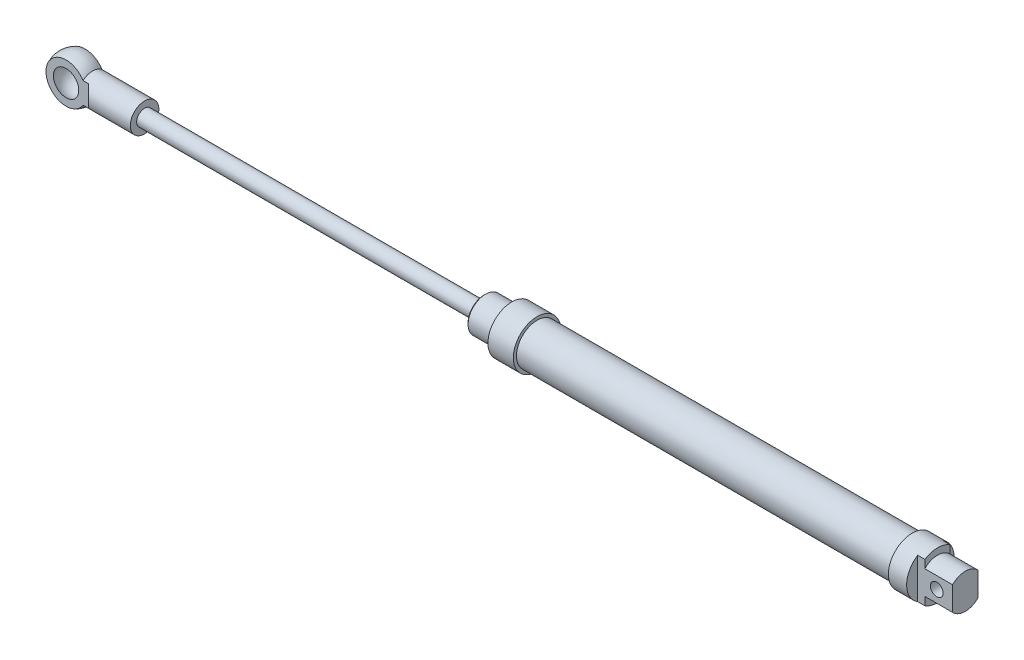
from build123d import *

# Parameters (mm, degrees)
ESQUISSE2_W             = 24.292392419
ESQUISSE2_H             = 10.895930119
ENL_V_MAT_EXTRU_1_DEPTH = 15
ESQUISSE3_R             = 4
ENL_V_MAT_EXTRU_2_DEPTH = 305.739642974
ENL_V_MAT_EXTRU_3_DEPTH = 15
CHANFREIN1_SIZE         = 1


with BuildPart() as part:
    # Esquisse1 → R_volution1 (revolve)
    with BuildSketch(Plane.XY):
        Polygon((0, 5), (0, 11), (17.5, 11), (17.5, 15), (33.5, 15), (33.5, 13), (270, 13), (270, 15), (286, 15), (286, 11), (303.5, 11), (303.5, 0), (-214.5, 0), (-214.5, 5), align=None)
    revolve(axis=Axis((303.5, 0, 0), (-1, 0, 0)))

    # Esquisse2 → Enl_v. mat.-Extru.1 (cut, symmetric)
    with BuildSketch(Plane(origin=(0, 0, 0), x_dir=(1, 0, 0), z_dir=(0, 1, 0))):
        with Locations((293.646196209, 13.44796506)):
            Rectangle(ESQUISSE2_W, ESQUISSE2_H)
        with Locations((293.646196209, -13.44796506)):
            Rectangle(ESQUISSE2_W, ESQUISSE2_H)
    extrude(amount=ENL_V_MAT_EXTRU_1_DEPTH, both=True, mode=Mode.SUBTRACT)

    # Esquisse3 → Enl_v. mat.-Extru.2 (cut, through all)
    with BuildSketch(Plane.XY.offset(8)):
        with Locations((293.5, 0)):
            Circle(ESQUISSE3_R)
    extrude(amount=-ENL_V_MAT_EXTRU_2_DEPTH, mode=Mode.SUBTRACT)

    # Esquisse4 → R_volution3 (revolve)
    with BuildSketch(Plane.XY):
        with BuildLine():
            Line((-246.776194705, 9), (-214, 9))
            Line((-214, 9), (-214, 0))
            Line((-214, 0), (-271.5, 0))
            ThreePointArc((-271.5, 0), (-262.28887909, 13.155479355), (-246.776194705, 9))
        make_face()
    revolve(axis=Axis((-199.414867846, 0, 0), (-1, 0, 0)))

    # Esquisse5 → Enl_v. mat.-Extru.3 (cut, symmetric)
    with BuildSketch(Plane(origin=(0, 0, 0), x_dir=(1, 0, 0), z_dir=(0, 1, 0))):
        Polygon((-277.549493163, 6), (-243.4, 6), (-236.544963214, 12.855036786), (-236.544963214, 18.158461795), (-277.549493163, 16.894663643), align=None)
        Polygon((-277.549493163, -16.894663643), (-277.549493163, -6), (-243.4, -6), (-236.544963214, -12.855036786), (-236.544963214, -18.158461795), align=None)
    extrude(amount=ENL_V_MAT_EXTRU_3_DEPTH, both=True, mode=Mode.SUBTRACT)

    # Esquisse6 → Enl_vement de mati_re-R_volution1 (revolve, cut)
    with BuildSketch(Plane.XY):
        with BuildLine():
            Line((-267.5, 0), (-247.5, 0))
            ThreePointArc((-247.5, 0), (-257.5, 10), (-267.5, 0))
        make_face()
    revolve(axis=Axis((-244.987387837, 0, 0), (-1, 0, 0)), mode=Mode.SUBTRACT)

    # Chanfrein1
    chanfrein1_edges = [part.edges().sort_by_distance(p)[0] for p in [
        (0, -11, 0),
    ]]
    chamfer(chanfrein1_edges, length=CHANFREIN1_SIZE)


solid = part.part
